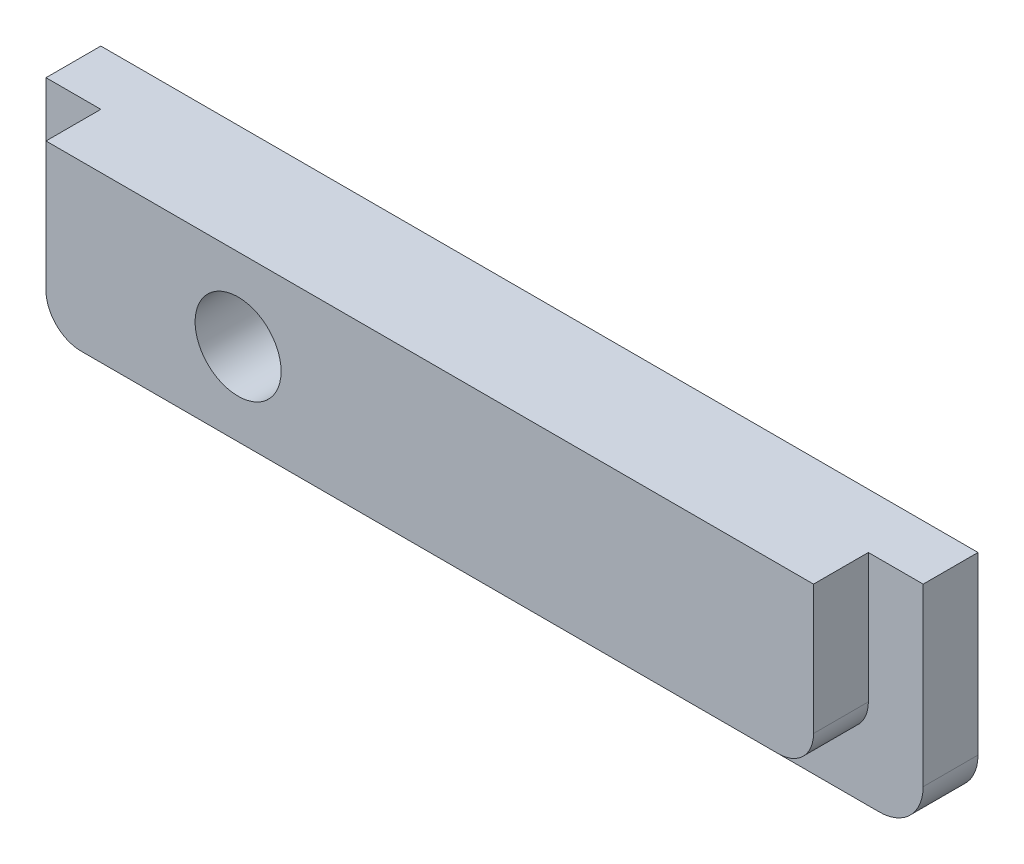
from build123d import *

# Parameters (mm, degrees)
SKETCH2_W           = 44.45
SKETCH2_H           = 9.525
BOSS_EXTRUDE1_DEPTH = 3.175
BOSS_EXTRUDE2_DEPTH = 3.175
FILLET1_R           = 2.032
FILLET2_R           = 2.54
SKETCH5_R           = 2.4892
CUT_EXTRUDE2_DEPTH  = 12.7


with BuildPart() as part:
    # Sketch2 → Boss-Extrude1 (new body)
    with BuildSketch(Plane.XY):
        with Locations((22.225, 4.7625)):
            Rectangle(SKETCH2_W, SKETCH2_H)
    extrude(amount=BOSS_EXTRUDE1_DEPTH)

    # Sketch3 → Boss-Extrude2 (add)
    with BuildSketch(Plane.XY):
        Polygon((-3.175, -3.175), (47.625, -3.175), (47.625, 9.525), (44.45, 9.525), (0, 9.525), (-3.175, 9.525), align=None)
    extrude(amount=-BOSS_EXTRUDE2_DEPTH)

    # Fillet1
    fillet1_edges = [part.edges().sort_by_distance(p)[0] for p in [
        (44.45, 0, 1.5875),
        (0, 0, 1.5875),
    ]]
    fillet(fillet1_edges, radius=FILLET1_R)

    # Fillet2
    fillet2_edges = [part.edges().sort_by_distance(p)[0] for p in [
        (-3.175, -3.175, -1.5875),
        (47.625, -3.175, -1.5875),
    ]]
    fillet(fillet2_edges, radius=FILLET2_R)

    # Sketch5 → Cut-Extrude2 (cut, symmetric)
    with BuildSketch(Plane.XY):
        with Locations((11.1252, 4.7752)):
            Circle(SKETCH5_R)
    extrude(amount=CUT_EXTRUDE2_DEPTH, both=True, mode=Mode.SUBTRACT)


solid = part.part
